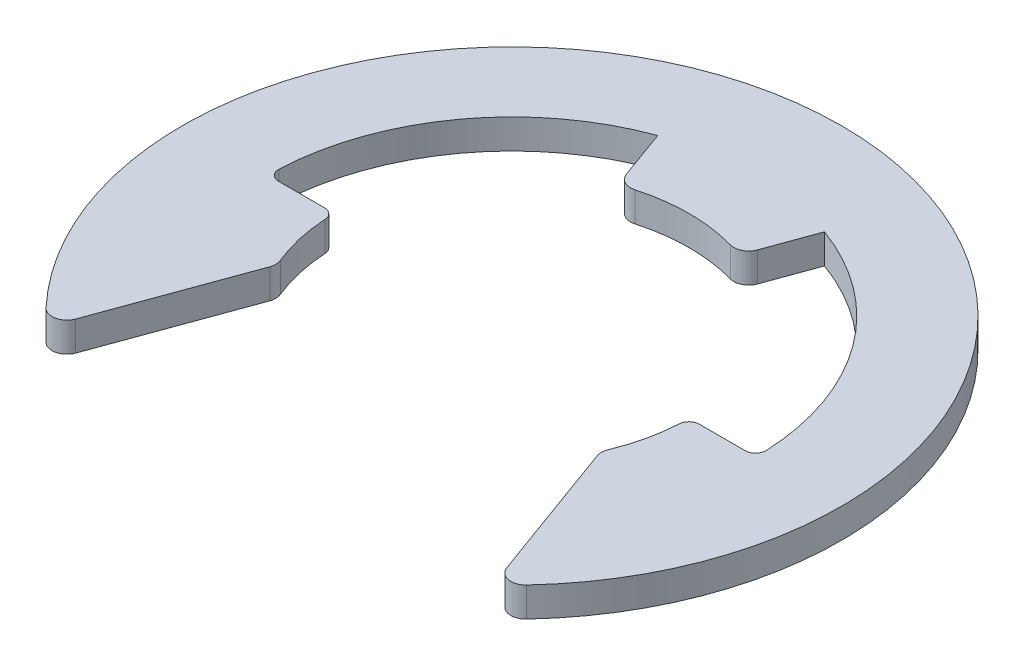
from build123d import *

# Parameters (mm, degrees)
BOSS_EXTRUDE1_DEPTH = 1
FILLET1_R           = 1
FILLET2_R           = 0.7


with BuildPart() as part:
    # Sketch2 → Boss-Extrude1 (new, symmetric)
    with BuildSketch(Plane(origin=(0, 0, 0), x_dir=(1, 0, 0), z_dir=(0, 1, 0))):
        with BuildLine():
            Line((-15.113379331, -16.397431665), (-10.94, -4.931166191))
            ThreePointArc((-10.94, -4.931166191), (-11.732007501, -2.521904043), (-12, 0))
            Line((-12, 0), (-16.5, 0))
            ThreePointArc((-16.5, 0), (-13.516008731, 9.4640112), (-5.643332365, 15.504928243))
            Line((-5.643332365, 15.504928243), (-4.10424172, 11.276311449))
            ThreePointArc((-4.10424172, 11.276311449), (0, 12), (4.10424172, 11.276311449))
            Line((4.10424172, 11.276311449), (5.643332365, 15.504928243))
            ThreePointArc((5.643332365, 15.504928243), (13.516008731, 9.4640112), (16.5, 0))
            Line((16.5, 0), (12, 0))
            ThreePointArc((12, 0), (11.732007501, -2.521904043), (10.94, -4.931166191))
            Line((10.94, -4.931166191), (15.113379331, -16.397431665))
            ThreePointArc((15.113379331, -16.397431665), (0, 22.3), (-15.113379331, -16.397431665))
        make_face()
    extrude(amount=BOSS_EXTRUDE1_DEPTH, both=True)

    # Fillet1
    fillet1_edges = [part.edges().sort_by_distance(p)[0] for p in [
        (-10.94, 0, 4.931166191),
        (-15.113379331, 0, 16.397431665),
        (15.113379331, 0, 16.397431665),
        (10.94, 0, 4.931166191),
        (4.10424172, 0, -11.276311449),
        (-4.10424172, 0, -11.276311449),
    ]]
    fillet(fillet1_edges, radius=FILLET1_R)

    # Fillet2
    fillet2_edges = [part.edges().sort_by_distance(p)[0] for p in [
        (-16.5, 0, 0),
        (-12, 0, 0),
        (12, 0, 0),
        (16.5, 0, 0),
    ]]
    fillet(fillet2_edges, radius=FILLET2_R)


solid = part.part
